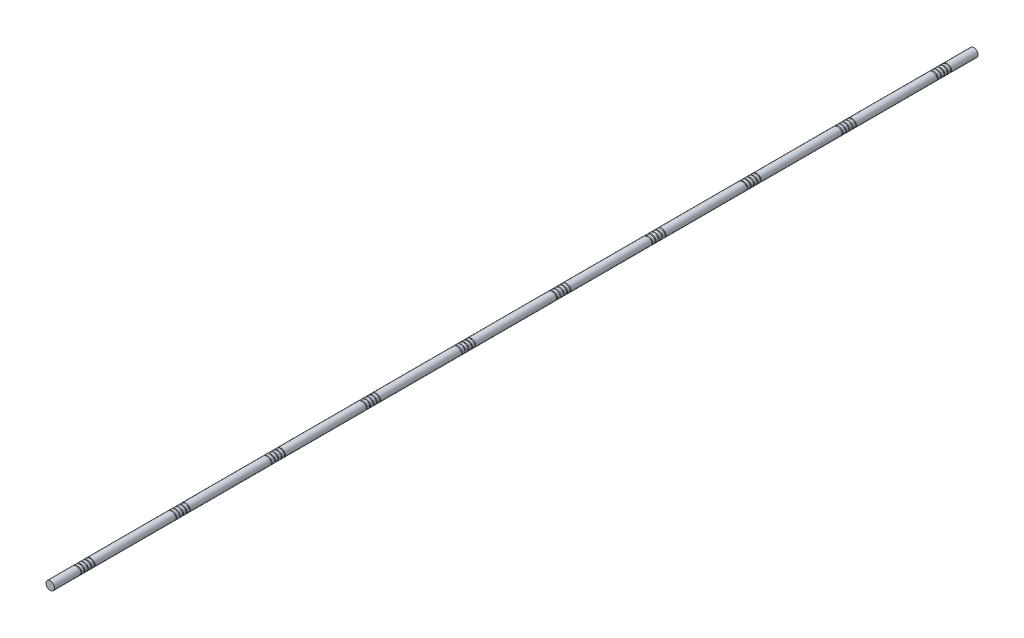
from build123d import *

# Parameters (mm, degrees)
SKETCH1_R              = 25
BOSS_EXTRUDE1_DEPTH    = 5500
CUT_SWEEP1_PITCH       = 20
CUT_SWEEP1_HEIGHT      = 100
CUT_SWEEP1_RADIUS      = 27.116666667
CUT_SWEEP1_START_ANGLE = -180
SKETCH3_R              = 3.175
LPATTERN1_COUNT        = 10
LPATTERN1_PITCH        = 566.666666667


with BuildPart() as part:
    # Sketch1 → Boss-Extrude1 (new body)
    with BuildSketch(Plane.XY):
        Circle(SKETCH1_R)
    extrude(amount=BOSS_EXTRUDE1_DEPTH)

    # Cut-Sweep1: sweep along a helix
    with BuildLine() as cut_sweep1_path:
        add(Helix(CUT_SWEEP1_PITCH, CUT_SWEEP1_HEIGHT, CUT_SWEEP1_RADIUS, center=(0, 0, 150), direction=(0, 0, 1), mode=Mode.PRIVATE).rotate(Axis((0, 0, 150), (0, 0, 1)), CUT_SWEEP1_START_ANGLE))
    # Sketch3 → Cut-Sweep1 (sweep, cut)
    with BuildSketch(Plane(origin=(0, 0, 0), x_dir=(1, 0, 0), z_dir=(0, 1, 0))):
        with Locations((-27.116666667, -150)):
            Circle(SKETCH3_R)
    cut_sweep1 = sweep(path=cut_sweep1_path.line, is_frenet=True, mode=Mode.SUBTRACT)

    # LPattern1: Cut-Sweep1 ×10
    with Locations(*[(0, 0, i * LPATTERN1_PITCH) for i in range(1, LPATTERN1_COUNT)]):
        add(cut_sweep1, mode=Mode.SUBTRACT)


solid = part.part
